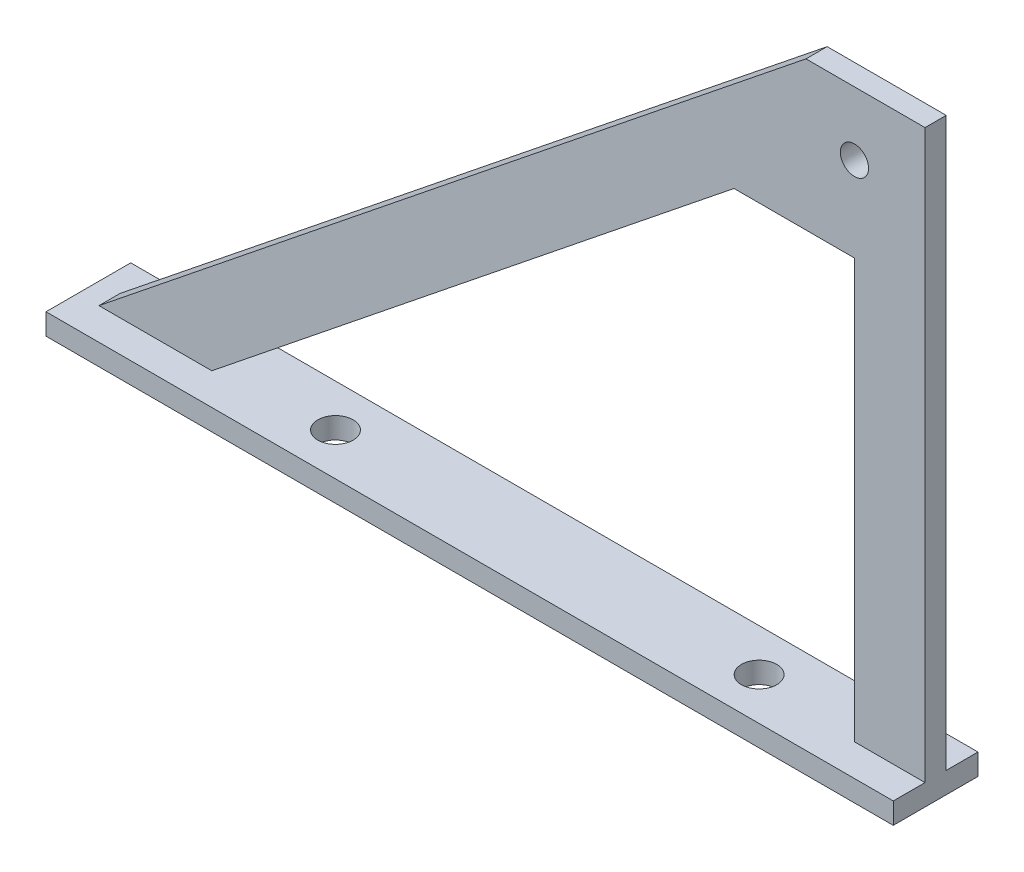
from build123d import *

# Parameters (mm, degrees)
SKETCH1_W             = 120
SKETCH1_H             = 12
BOSS_EXTRUDE1_DEPTH   = 3
BOSS_EXTRUDE1_2_DEPTH = 3
BOSS_EXTRUDE2_START   = -7.5
BOSS_EXTRUDE2_DEPTH   = 3
BOSS_EXTRUDE3_START   = -7.5
BOSS_EXTRUDE3_DEPTH   = 3
SKETCH4_R             = 2.5
CUT_EXTRUDE1_DEPTH    = 7
BOSS_EXTRUDE4_DEPTH   = 3
BOSS_EXTRUDE5_DEPTH   = 3
SKETCH7_R             = 2
CUT_EXTRUDE2_DEPTH    = 120
CUT_EXTRUDE3_DEPTH    = 120
SKETCH9_W             = 131.904829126
SKETCH9_H             = 109.010600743
CUT_EXTRUDE4_DEPTH    = 20


with BuildPart() as part:
    # Sketch1 → Boss-Extrude1 (new body)
    with BuildSketch(Plane(origin=(0, 0, 0), x_dir=(1, 0, 0), z_dir=(0, 1, 0))):
        with Locations((0, -56)):
            Rectangle(SKETCH1_W, SKETCH1_H)
    extrude(amount=BOSS_EXTRUDE1_DEPTH)

    # Sketch2 → Boss-Extrude2 (add)
    with BuildSketch(Plane.XY.offset(62).offset(BOSS_EXTRUDE2_START)):
        Polygon((-57, 3), (60, 96.866927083), (60, 3), (50, 3), (50, 76.023599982), (-41.019930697, 3), align=None)
    extrude(amount=BOSS_EXTRUDE2_DEPTH)


with BuildPart() as body_2:
    # Sketch1 → Boss-Extrude1 2 (new body)
    with BuildSketch(Plane(origin=(0, 0, 0), x_dir=(1, 0, 0), z_dir=(0, 1, 0))):
        with Locations((0, 56)):
            Rectangle(SKETCH1_W, SKETCH1_H)
    extrude(amount=BOSS_EXTRUDE1_2_DEPTH)

    # Sketch3 → Boss-Extrude3 (add)
    with BuildSketch(Plane.XY.offset(-50).offset(BOSS_EXTRUDE3_START)):
        Polygon((60, 96.866927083), (-57, 3), (-41.019930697, 3), (50, 76.023599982), (50, 3), (60, 3), align=None)
    extrude(amount=BOSS_EXTRUDE3_DEPTH)


with BuildPart() as cut_extrude1_tool:
    # Sketch4 → Cut-Extrude1 (new body)
    with BuildSketch(Plane(origin=(0, 3, 0), x_dir=(1, 0, 0), z_dir=(0, 1, 0))):
        with Locations(Location((-25, 56, 0), (0, 0, 270))):
            Circle(SKETCH4_R)
        with Locations(Location((35, 56, 0), (0, 0, 270))):
            Circle(SKETCH4_R)
        with Locations(Location((-25, -56, 0), (0, 0, 270))):
            Circle(SKETCH4_R)
        with Locations(Location((35, -56, 0), (0, 0, 270))):
            Circle(SKETCH4_R)
    extrude(amount=-CUT_EXTRUDE1_DEPTH)


with BuildPart() as part_1:
    add(part.part)

    # Cut-Extrude1: cut by cut_extrude1_tool
    add(cut_extrude1_tool.part, mode=Mode.SUBTRACT)

    # Sketch5 → Boss-Extrude4 (add)
    with BuildSketch(Plane.XY.offset(57.5)):
        Polygon((32.94293004, 62.339029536), (50, 62.339029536), (55.48943836, 62.339029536), (55.48943836, 76.828036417), (50, 83.67032164), (32.94293004, 69.985751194), align=None)
    extrude(amount=-BOSS_EXTRUDE4_DEPTH)


with BuildPart() as body_2_1:
    add(body_2.part)

    # Cut-Extrude1: cut by cut_extrude1_tool
    add(cut_extrude1_tool.part, mode=Mode.SUBTRACT)

    # Sketch6 → Boss-Extrude5 (add)
    with BuildSketch(Plane.XY.offset(-54.5)):
        Polygon((32.94293004, 62.339029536), (50, 62.339029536), (55.48943836, 62.339029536), (55.48943836, 76.828036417), (50, 83.67032164), (32.94293004, 69.985751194), align=None)
    extrude(amount=-BOSS_EXTRUDE5_DEPTH)


with BuildPart() as cut_extrude2_tool:
    # Sketch7 → Cut-Extrude2 (new body)
    with BuildSketch(Plane.XY.offset(57.5)):
        with Locations(Location((50, 74.339029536, 0), (0, 0, 180))):
            Circle(SKETCH7_R)
    extrude(amount=-CUT_EXTRUDE2_DEPTH)


with BuildPart() as part_2:
    add(part_1.part)

    # Cut-Extrude2: cut by cut_extrude2_tool
    add(cut_extrude2_tool.part, mode=Mode.SUBTRACT)


with BuildPart() as body_2_2:
    add(body_2_1.part)

    # Cut-Extrude2: cut by cut_extrude2_tool
    add(cut_extrude2_tool.part, mode=Mode.SUBTRACT)


with BuildPart() as cut_extrude3_tool:
    # Sketch8 → Cut-Extrude3 (new body)
    with BuildSketch(Plane.XY.offset(57.5)):
        Polygon((60, 83.339029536), (43.138214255, 83.339029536), (60, 96.866927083), align=None)
    extrude(amount=-CUT_EXTRUDE3_DEPTH)


with BuildPart() as part_3:
    add(part_2.part)

    # Cut-Extrude3: cut by cut_extrude3_tool
    add(cut_extrude3_tool.part, mode=Mode.SUBTRACT)

    # Sketch9 → Cut-Extrude4 (cut)
    with BuildSketch(Plane.XY.offset(62)):
        with Locations((0, 32.138199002)):
            Rectangle(SKETCH9_W, SKETCH9_H)
    extrude(amount=-CUT_EXTRUDE4_DEPTH, mode=Mode.SUBTRACT)


with BuildPart() as body_2_3:
    add(body_2_2.part)

    # Cut-Extrude3: cut by cut_extrude3_tool
    add(cut_extrude3_tool.part, mode=Mode.SUBTRACT)


solid = body_2_3.part
